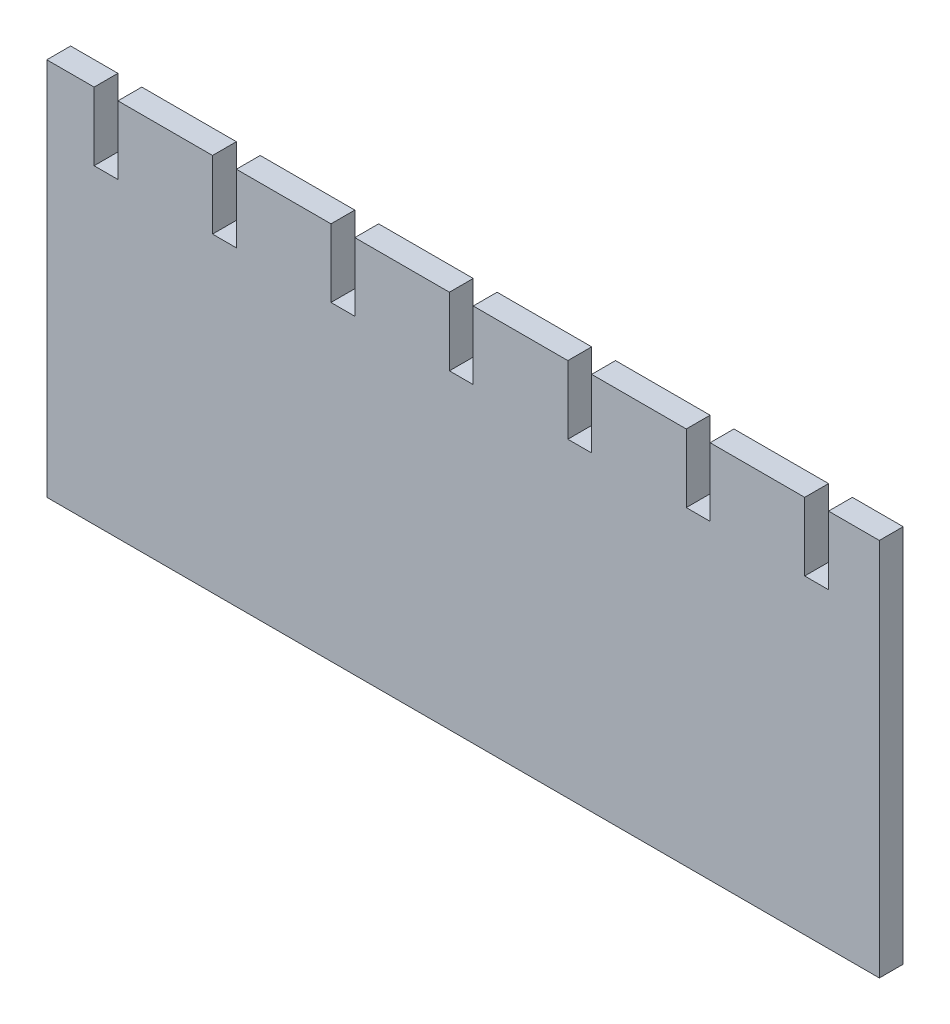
from build123d import *

# Parameters (mm, degrees)
BOSS_EXTRUDE1_DEPTH = 16.002


with BuildPart() as part:
    # Sketch1 → Boss-Extrude1 (new body)
    with BuildSketch(Plane.XY):
        Polygon((-53.599909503, 165.292065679), (9.900090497, 165.292065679), (9.900090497, 119.572084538), (25.900083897, 119.572084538), (25.900083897, 165.292065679), (89.400083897, 165.292065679), (89.400083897, 119.572084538), (105.402083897, 119.572084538), (105.402083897, 165.292065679), (168.902083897, 165.292065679), (168.902083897, 119.572084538), (184.904083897, 119.572084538), (184.904083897, 165.292065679), (248.404083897, 165.292065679), (248.404083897, 119.572084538), (264.406083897, 119.572084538), (264.406083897, 165.292065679), (298.517953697, 165.292065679), (298.517953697, -89.08059796), (-260.351896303, -89.08059796), (-260.351896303, 165.292065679), (-228.601896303, 165.292065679), (-228.601896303, 119.566350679), (-212.599896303, 119.566350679), (-212.599896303, 165.292065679), (-149.099896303, 165.292065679), (-149.099896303, 119.572084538), (-133.099902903, 119.572084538), (-133.099902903, 165.292065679), (-69.599902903, 165.292065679), (-69.599902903, 119.572084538), (-53.599909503, 119.572084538), align=None)
    extrude(amount=BOSS_EXTRUDE1_DEPTH)


solid = part.part
